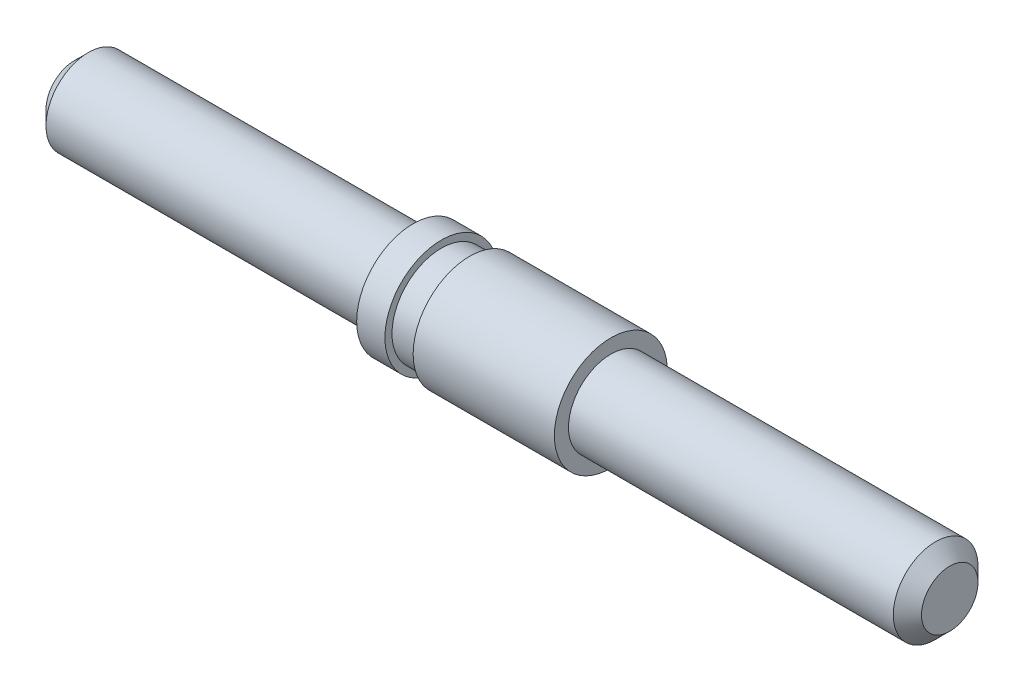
from build123d import *


with BuildPart() as part:
    # Esquisse1 → Base-R_volution (revolve)
    with BuildSketch(Plane(origin=(0, 0, 0), x_dir=(-1, 0, 0), z_dir=(0, 0, -1)), mode=Mode.PRIVATE) as base_r_volution_sk:
        Polygon((-26, 21), (-26, 20), (5, 20), (5, 21), (4.5, 21.5), (-7, 21.5), (-7, 22), (-8, 22), (-8, 21.75), (-9, 21.75), (-9, 22), (-14, 22), (-14, 21.5), (-25.5, 21.5), align=None)
    revolve(base_r_volution_sk.sketch.rotate(Axis((26, 20, 0), (-1, 0, 0)), 270), axis=Axis((26, 20, 0), (-1, 0, 0)))


solid = part.part
